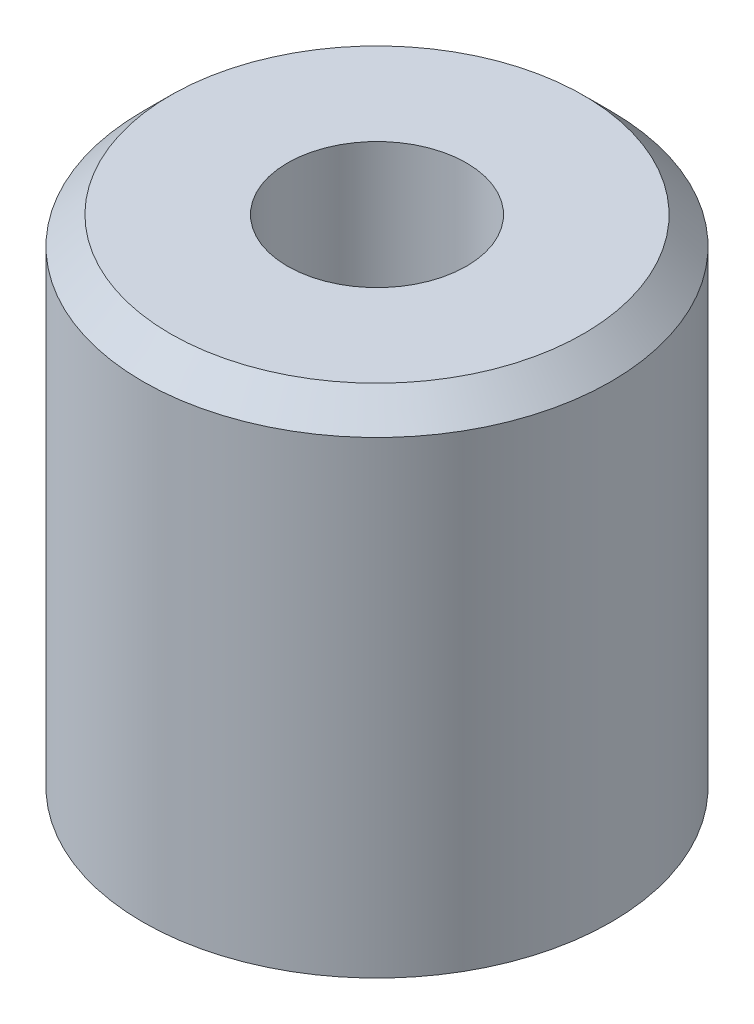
ISO-10303-21;
HEADER;
FILE_DESCRIPTION(('STEP AP214'),'2;1');
FILE_NAME('part.step','',(''),(''),'','','');
FILE_SCHEMA(('AUTOMOTIVE_DESIGN { 1 0 10303 214 1 1 1 1 }'));
ENDSEC;
DATA;
#1=APPLICATION_CONTEXT('core data for automotive mechanical design processes');
#2=APPLICATION_PROTOCOL_DEFINITION('international standard','automotive_design',2000,#1);
#3=PRODUCT_CONTEXT('',#1,'mechanical');
#4=PRODUCT('Part','Part','',(#3));
#5=PRODUCT_RELATED_PRODUCT_CATEGORY('part','',(#4));
#6=PRODUCT_DEFINITION_FORMATION('','',#4);
#7=PRODUCT_DEFINITION_CONTEXT('part definition',#1,'design');
#8=PRODUCT_DEFINITION('design','',#6,#7);
#9=PRODUCT_DEFINITION_SHAPE('','',#8);
#10=(LENGTH_UNIT() NAMED_UNIT(*) SI_UNIT(.MILLI.,.METRE.));
#11=(NAMED_UNIT(*) PLANE_ANGLE_UNIT() SI_UNIT($,.RADIAN.));
#12=(NAMED_UNIT(*) SI_UNIT($,.STERADIAN.) SOLID_ANGLE_UNIT());
#13=UNCERTAINTY_MEASURE_WITH_UNIT(LENGTH_MEASURE(1.E-05),#10,'distance_accuracy_value','');
#14=(GEOMETRIC_REPRESENTATION_CONTEXT(3) GLOBAL_UNCERTAINTY_ASSIGNED_CONTEXT((#13)) GLOBAL_UNIT_ASSIGNED_CONTEXT((#10,
#11,#12)) REPRESENTATION_CONTEXT('',''));
#15=CARTESIAN_POINT('',(0.,0.,0.));
#16=DIRECTION('',(0.,0.,1.));
#17=DIRECTION('',(1.,0.,0.));
#18=AXIS2_PLACEMENT_3D('',#15,#16,#17);
#19=CARTESIAN_POINT('',(0.,18.,0.));
#20=DIRECTION('',(0.,-1.,0.));
#21=DIRECTION('',(0.,0.,-1.));
#22=AXIS2_PLACEMENT_3D('',#19,#20,#21);
#23=CYLINDRICAL_SURFACE('',#22,8.5);
#24=CARTESIAN_POINT('',(0.,17.,0.));
#25=DIRECTION('',(0.,1.,0.));
#26=DIRECTION('',(0.,0.,1.));
#27=AXIS2_PLACEMENT_3D('',#24,#25,#26);
#28=CIRCLE('',#27,8.5);
#29=CARTESIAN_POINT('',(0.,17.,8.5));
#30=VERTEX_POINT('',#29);
#31=EDGE_CURVE('E10',#30,#30,#28,.F.);
#32=ORIENTED_EDGE('',*,*,#31,.T.);
#33=EDGE_LOOP('',(#32));
#34=FACE_BOUND('',#33,.T.);
#35=CARTESIAN_POINT('',(0.,0.,0.));
#36=DIRECTION('',(0.,1.,0.));
#37=DIRECTION('',(0.,0.,1.));
#38=AXIS2_PLACEMENT_3D('',#35,#36,#37);
#39=CIRCLE('',#38,8.5);
#40=CARTESIAN_POINT('',(0.,0.,8.5));
#41=VERTEX_POINT('',#40);
#42=EDGE_CURVE('E46',#41,#41,#39,.T.);
#43=ORIENTED_EDGE('',*,*,#42,.T.);
#44=EDGE_LOOP('',(#43));
#45=FACE_BOUND('',#44,.T.);
#46=ADVANCED_FACE('F35',(#34,#45),#23,.T.);
#47=CARTESIAN_POINT('',(0.,18.,0.));
#48=DIRECTION('',(0.,1.,0.));
#49=DIRECTION('',(0.,0.,1.));
#50=AXIS2_PLACEMENT_3D('',#47,#48,#49);
#51=PLANE('',#50);
#52=CARTESIAN_POINT('',(0.,18.,0.));
#53=DIRECTION('',(0.,1.,0.));
#54=DIRECTION('',(0.,0.,1.));
#55=AXIS2_PLACEMENT_3D('',#52,#53,#54);
#56=CIRCLE('',#55,3.25);
#57=CARTESIAN_POINT('',(0.,18.,3.25));
#58=VERTEX_POINT('',#57);
#59=EDGE_CURVE('E53',#58,#58,#56,.T.);
#60=ORIENTED_EDGE('',*,*,#59,.F.);
#61=EDGE_LOOP('',(#60));
#62=FACE_BOUND('',#61,.T.);
#63=CARTESIAN_POINT('',(0.,18.,0.));
#64=DIRECTION('',(0.,1.,0.));
#65=DIRECTION('',(0.,0.,1.));
#66=AXIS2_PLACEMENT_3D('',#63,#64,#65);
#67=CIRCLE('',#66,7.5);
#68=CARTESIAN_POINT('',(0.,18.,7.5));
#69=VERTEX_POINT('',#68);
#70=EDGE_CURVE('E42',#69,#69,#67,.T.);
#71=ORIENTED_EDGE('',*,*,#70,.T.);
#72=EDGE_LOOP('',(#71));
#73=FACE_BOUND('',#72,.T.);
#74=ADVANCED_FACE('F68',(#62,#73),#51,.T.);
#75=CARTESIAN_POINT('',(0.,0.,0.));
#76=DIRECTION('',(0.,1.,0.));
#77=DIRECTION('',(0.,0.,1.));
#78=AXIS2_PLACEMENT_3D('',#75,#76,#77);
#79=PLANE('',#78);
#80=CARTESIAN_POINT('',(0.,0.,0.));
#81=DIRECTION('',(0.,1.,0.));
#82=DIRECTION('',(0.,0.,1.));
#83=AXIS2_PLACEMENT_3D('',#80,#81,#82);
#84=CIRCLE('',#83,3.25);
#85=CARTESIAN_POINT('',(0.,0.,3.25));
#86=VERTEX_POINT('',#85);
#87=EDGE_CURVE('E50',#86,#86,#84,.T.);
#88=ORIENTED_EDGE('',*,*,#87,.T.);
#89=EDGE_LOOP('',(#88));
#90=FACE_BOUND('',#89,.T.);
#91=ORIENTED_EDGE('',*,*,#42,.F.);
#92=EDGE_LOOP('',(#91));
#93=FACE_BOUND('',#92,.T.);
#94=ADVANCED_FACE('F59',(#90,#93),#79,.F.);
#95=CARTESIAN_POINT('',(0.,18.,0.));
#96=DIRECTION('',(0.,-1.,0.));
#97=DIRECTION('',(0.,0.,-1.));
#98=AXIS2_PLACEMENT_3D('',#95,#96,#97);
#99=CONICAL_SURFACE('',#98,7.5,0.785398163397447);
#100=ORIENTED_EDGE('',*,*,#31,.F.);
#101=EDGE_LOOP('',(#100));
#102=FACE_BOUND('',#101,.T.);
#103=ORIENTED_EDGE('',*,*,#70,.F.);
#104=EDGE_LOOP('',(#103));
#105=FACE_BOUND('',#104,.T.);
#106=ADVANCED_FACE('F37',(#102,#105),#99,.T.);
#107=CARTESIAN_POINT('',(0.,0.,0.));
#108=DIRECTION('',(0.,1.,0.));
#109=DIRECTION('',(0.,0.,1.));
#110=AXIS2_PLACEMENT_3D('',#107,#108,#109);
#111=CYLINDRICAL_SURFACE('',#110,3.25);
#112=ORIENTED_EDGE('',*,*,#87,.F.);
#113=EDGE_LOOP('',(#112));
#114=FACE_BOUND('',#113,.T.);
#115=ORIENTED_EDGE('',*,*,#59,.T.);
#116=EDGE_LOOP('',(#115));
#117=FACE_BOUND('',#116,.T.);
#118=ADVANCED_FACE('F62',(#114,#117),#111,.F.);
#119=CLOSED_SHELL('',(#46,#74,#94,#106,#118));
#120=MANIFOLD_SOLID_BREP('B2',#119);
#121=ADVANCED_BREP_SHAPE_REPRESENTATION('',(#18,#120),#14);
#122=SHAPE_DEFINITION_REPRESENTATION(#9,#121);
ENDSEC;
END-ISO-10303-21;
